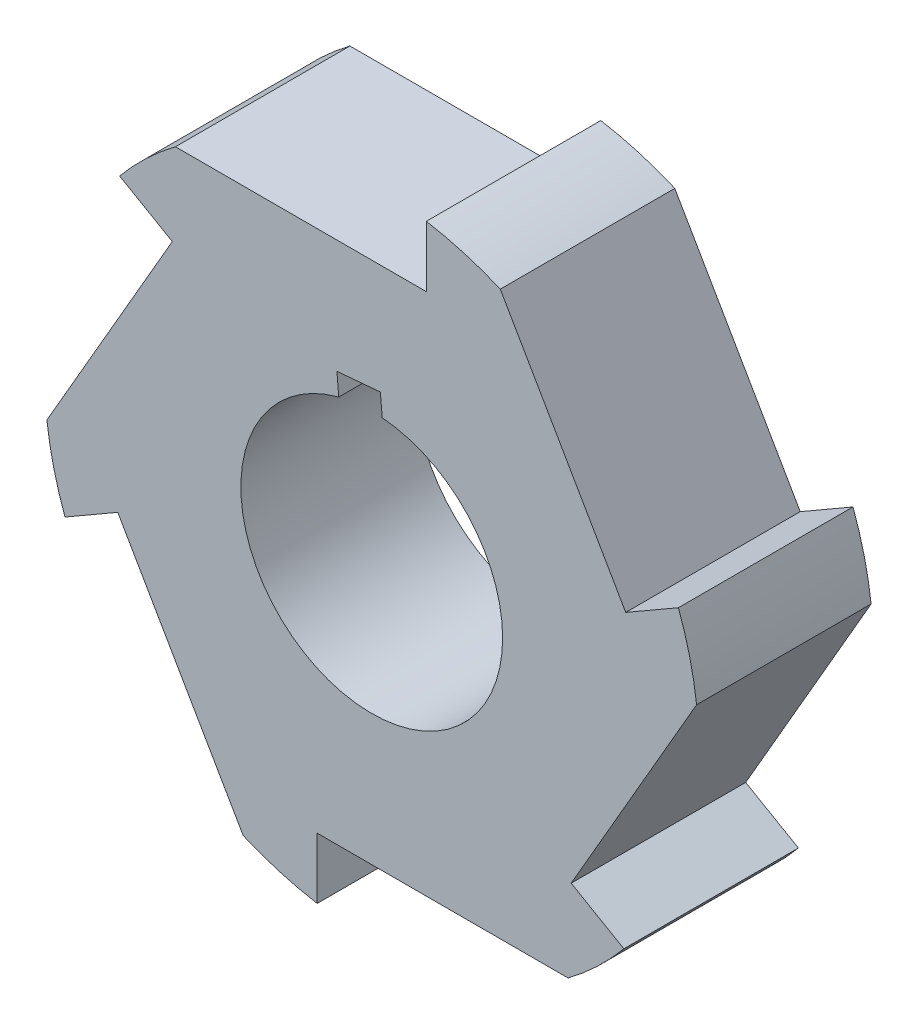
from build123d import *

# Parameters (mm, degrees)
ESQUISSE1_R                  = 15
BASEEXTRUSION_DEPTH          = 8
ENL_V_MAT_EXTRUSION1_DEPTH   = 23.671568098
R_P_TITION_CIRCULAIRE1_COUNT = 6


with BuildPart() as part:
    # Esquisse1 → BaseExtrusion (new body)
    with BuildSketch(Plane.XY):
        Circle(ESQUISSE1_R)
        with BuildLine():
            Line((0.48057437, 5.980723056), (0.394820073, 6.96089916))
            Line((0.394820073, 6.96089916), (-1.597569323, 6.786587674))
            Line((-1.597569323, 6.786587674), (-1.511815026, 5.806411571))
            ThreePointArc((-1.511815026, 5.806411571), (0.522934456, -5.977168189), (0.48057437, 5.980723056))
        make_face(mode=Mode.SUBTRACT)
    extrude(amount=BASEEXTRUSION_DEPTH)

    # Esquisse2 → Enl_v. mat.-Extrusion1 (cut, through all)
    with BuildSketch(Plane.XY.offset(8)):
        with BuildLine():
            Line((-9, 12), (2.5, 12))
            Line((2.5, 12), (2.5, 14.790199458))
            ThreePointArc((2.5, 14.790199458), (-3.536778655, 14.577077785), (-9, 12))
        make_face()
    enl_v_mat_extrusion1 = extrude(amount=-ENL_V_MAT_EXTRUSION1_DEPTH, mode=Mode.SUBTRACT)

    # R_p_tition circulaire1: Enl_v. mat.-Extrusion1 ×6 about axis
    r_p_tition_circulaire1_axis = Axis((0, 0, 0), (0, 0, 1))
    for i in range(1, R_P_TITION_CIRCULAIRE1_COUNT):
        add(enl_v_mat_extrusion1.rotate(r_p_tition_circulaire1_axis, i * 360 / R_P_TITION_CIRCULAIRE1_COUNT), mode=Mode.SUBTRACT)


solid = part.part
